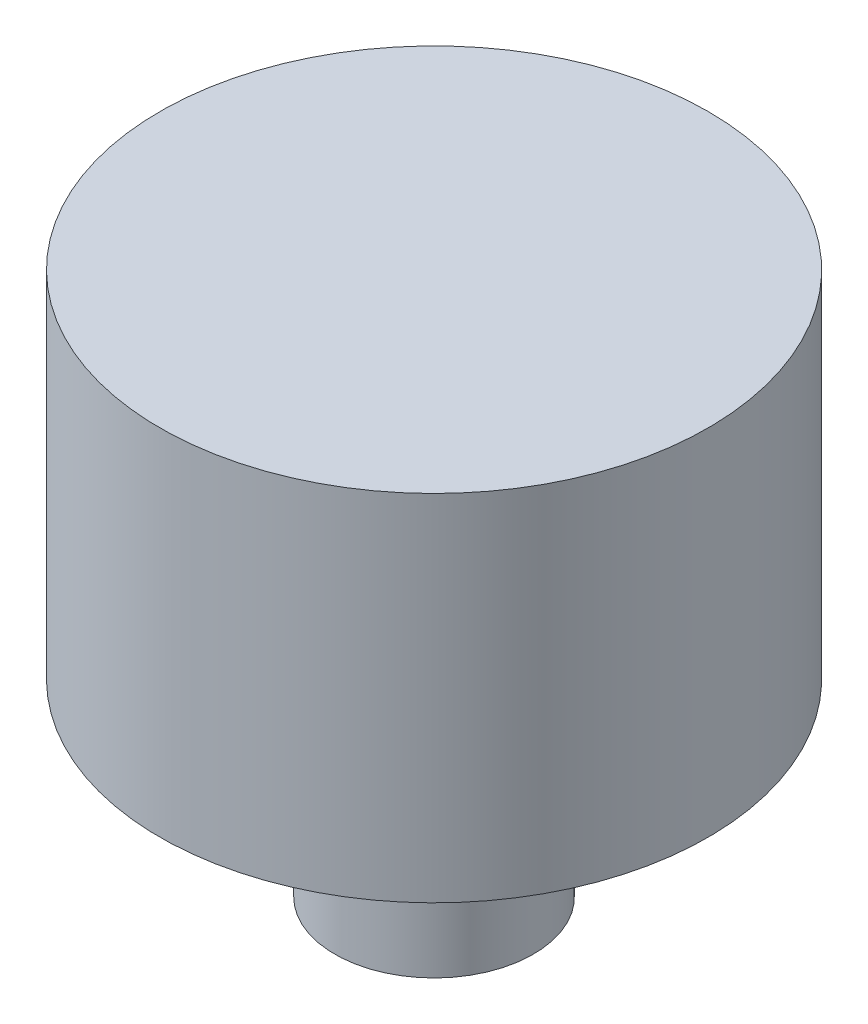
ISO-10303-21;
HEADER;
FILE_DESCRIPTION(('STEP AP214'),'2;1');
FILE_NAME('part.step','',(''),(''),'','','');
FILE_SCHEMA(('AUTOMOTIVE_DESIGN { 1 0 10303 214 1 1 1 1 }'));
ENDSEC;
DATA;
#1=APPLICATION_CONTEXT('core data for automotive mechanical design processes');
#2=APPLICATION_PROTOCOL_DEFINITION('international standard','automotive_design',2000,#1);
#3=PRODUCT_CONTEXT('',#1,'mechanical');
#4=PRODUCT('Part','Part','',(#3));
#5=PRODUCT_RELATED_PRODUCT_CATEGORY('part','',(#4));
#6=PRODUCT_DEFINITION_FORMATION('','',#4);
#7=PRODUCT_DEFINITION_CONTEXT('part definition',#1,'design');
#8=PRODUCT_DEFINITION('design','',#6,#7);
#9=PRODUCT_DEFINITION_SHAPE('','',#8);
#10=(LENGTH_UNIT() NAMED_UNIT(*) SI_UNIT(.MILLI.,.METRE.));
#11=(NAMED_UNIT(*) PLANE_ANGLE_UNIT() SI_UNIT($,.RADIAN.));
#12=(NAMED_UNIT(*) SI_UNIT($,.STERADIAN.) SOLID_ANGLE_UNIT());
#13=UNCERTAINTY_MEASURE_WITH_UNIT(LENGTH_MEASURE(1.E-05),#10,'distance_accuracy_value','');
#14=(GEOMETRIC_REPRESENTATION_CONTEXT(3) GLOBAL_UNCERTAINTY_ASSIGNED_CONTEXT((#13)) GLOBAL_UNIT_ASSIGNED_CONTEXT((#10,
#11,#12)) REPRESENTATION_CONTEXT('',''));
#15=CARTESIAN_POINT('',(0.,0.,0.));
#16=DIRECTION('',(0.,0.,1.));
#17=DIRECTION('',(1.,0.,0.));
#18=AXIS2_PLACEMENT_3D('',#15,#16,#17);
#19=CARTESIAN_POINT('',(0.,17.85,0.));
#20=DIRECTION('',(0.,-1.,0.));
#21=DIRECTION('',(0.,0.,-1.));
#22=AXIS2_PLACEMENT_3D('',#19,#20,#21);
#23=CYLINDRICAL_SURFACE('',#22,27.6000000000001);
#24=CARTESIAN_POINT('',(0.,17.85,0.));
#25=DIRECTION('',(0.,1.,0.));
#26=DIRECTION('',(0.,0.,1.));
#27=AXIS2_PLACEMENT_3D('',#24,#25,#26);
#28=CIRCLE('',#27,27.6000000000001);
#29=CARTESIAN_POINT('',(0.,17.85,-27.6000000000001));
#30=VERTEX_POINT('',#29);
#31=EDGE_CURVE('E41',#30,#30,#28,.T.);
#32=CARTESIAN_POINT('',(0.,-17.85,0.));
#33=DIRECTION('',(0.,1.,0.));
#34=DIRECTION('',(0.,0.,1.));
#35=AXIS2_PLACEMENT_3D('',#32,#33,#34);
#36=CIRCLE('',#35,27.6000000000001);
#37=CARTESIAN_POINT('',(0.,-17.85,-27.6000000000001));
#38=VERTEX_POINT('',#37);
#39=EDGE_CURVE('E37',#38,#38,#36,.T.);
#40=CARTESIAN_POINT('',(0.,17.85,-27.6000000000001));
#41=CARTESIAN_POINT('',(0.,17.478125,-27.6000000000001));
#42=CARTESIAN_POINT('',(0.,17.10625,-27.6000000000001));
#43=CARTESIAN_POINT('',(0.,16.3625,-27.6000000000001));
#44=CARTESIAN_POINT('',(0.,15.990625,-27.6000000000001));
#45=CARTESIAN_POINT('',(0.,15.246875,-27.6000000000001));
#46=CARTESIAN_POINT('',(0.,14.875,-27.6000000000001));
#47=CARTESIAN_POINT('',(0.,14.13125,-27.6000000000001));
#48=CARTESIAN_POINT('',(0.,13.759375,-27.6000000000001));
#49=CARTESIAN_POINT('',(0.,13.015625,-27.6000000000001));
#50=CARTESIAN_POINT('',(0.,12.64375,-27.6000000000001));
#51=CARTESIAN_POINT('',(0.,11.9,-27.6000000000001));
#52=CARTESIAN_POINT('',(0.,11.528125,-27.6000000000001));
#53=CARTESIAN_POINT('',(0.,10.784375,-27.6000000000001));
#54=CARTESIAN_POINT('',(0.,10.4125,-27.6000000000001));
#55=CARTESIAN_POINT('',(0.,9.66875,-27.6000000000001));
#56=CARTESIAN_POINT('',(0.,9.296875,-27.6000000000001));
#57=CARTESIAN_POINT('',(0.,8.553125,-27.6000000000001));
#58=CARTESIAN_POINT('',(0.,8.18125,-27.6000000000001));
#59=CARTESIAN_POINT('',(0.,7.4375,-27.6000000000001));
#60=CARTESIAN_POINT('',(0.,7.065625,-27.6000000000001));
#61=CARTESIAN_POINT('',(0.,6.321875,-27.6000000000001));
#62=CARTESIAN_POINT('',(0.,5.95,-27.6000000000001));
#63=CARTESIAN_POINT('',(0.,5.20625,-27.6000000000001));
#64=CARTESIAN_POINT('',(0.,4.834375,-27.6000000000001));
#65=CARTESIAN_POINT('',(0.,4.090625,-27.6000000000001));
#66=CARTESIAN_POINT('',(0.,3.71875,-27.6000000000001));
#67=CARTESIAN_POINT('',(0.,2.975,-27.6000000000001));
#68=CARTESIAN_POINT('',(0.,2.603125,-27.6000000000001));
#69=CARTESIAN_POINT('',(0.,1.859375,-27.6000000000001));
#70=CARTESIAN_POINT('',(0.,1.4875,-27.6000000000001));
#71=CARTESIAN_POINT('',(0.,0.743749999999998,-27.6000000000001));
#72=CARTESIAN_POINT('',(0.,0.371874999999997,-27.6000000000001));
#73=CARTESIAN_POINT('',(0.,-0.371875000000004,-27.6000000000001));
#74=CARTESIAN_POINT('',(0.,-0.743750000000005,-27.6000000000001));
#75=CARTESIAN_POINT('',(0.,-1.48750000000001,-27.6000000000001));
#76=CARTESIAN_POINT('',(0.,-1.859375,-27.6000000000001));
#77=CARTESIAN_POINT('',(0.,-2.603125,-27.6000000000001));
#78=CARTESIAN_POINT('',(0.,-2.975,-27.6000000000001));
#79=CARTESIAN_POINT('',(0.,-3.71875,-27.6000000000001));
#80=CARTESIAN_POINT('',(0.,-4.090625,-27.6000000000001));
#81=CARTESIAN_POINT('',(0.,-4.834375,-27.6000000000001));
#82=CARTESIAN_POINT('',(0.,-5.20625000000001,-27.6000000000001));
#83=CARTESIAN_POINT('',(0.,-5.95000000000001,-27.6000000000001));
#84=CARTESIAN_POINT('',(0.,-6.32187500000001,-27.6000000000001));
#85=CARTESIAN_POINT('',(0.,-7.06562500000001,-27.6000000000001));
#86=CARTESIAN_POINT('',(0.,-7.4375,-27.6000000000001));
#87=CARTESIAN_POINT('',(0.,-8.18125,-27.6000000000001));
#88=CARTESIAN_POINT('',(0.,-8.553125,-27.6000000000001));
#89=CARTESIAN_POINT('',(0.,-9.29687500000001,-27.6000000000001));
#90=CARTESIAN_POINT('',(0.,-9.66875000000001,-27.6000000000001));
#91=CARTESIAN_POINT('',(0.,-10.4125,-27.6000000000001));
#92=CARTESIAN_POINT('',(0.,-10.784375,-27.6000000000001));
#93=CARTESIAN_POINT('',(0.,-11.528125,-27.6000000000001));
#94=CARTESIAN_POINT('',(0.,-11.9,-27.6000000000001));
#95=CARTESIAN_POINT('',(0.,-12.64375,-27.6000000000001));
#96=CARTESIAN_POINT('',(0.,-13.015625,-27.6000000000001));
#97=CARTESIAN_POINT('',(0.,-13.759375,-27.6000000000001));
#98=CARTESIAN_POINT('',(0.,-14.13125,-27.6000000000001));
#99=CARTESIAN_POINT('',(0.,-14.875,-27.6000000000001));
#100=CARTESIAN_POINT('',(0.,-15.246875,-27.6000000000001));
#101=CARTESIAN_POINT('',(0.,-15.990625,-27.6000000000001));
#102=CARTESIAN_POINT('',(0.,-16.3625,-27.6000000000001));
#103=CARTESIAN_POINT('',(0.,-17.10625,-27.6000000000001));
#104=CARTESIAN_POINT('',(0.,-17.478125,-27.6000000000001));
#105=CARTESIAN_POINT('',(0.,-17.85,-27.6000000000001));
#106=B_SPLINE_CURVE_WITH_KNOTS('',3,(#40,#41,#42,#43,#44,#45,#46,#47,#48,#49,#50,#51,#52,#53,
#54,#55,#56,#57,#58,#59,#60,#61,#62,#63,#64,#65,#66,#67,#68,#69,#70,#71,#72,#73,#74,#75,#76,#77,
#78,#79,#80,#81,#82,#83,#84,#85,#86,#87,#88,#89,#90,#91,#92,#93,#94,#95,#96,#97,#98,#99,#100,
#101,#102,#103,#104,#105),.UNSPECIFIED.,.F.,.F.,(4,2,2,2,2,2,2,2,2,2,2,2,2,2,2,2,2,2,2,2,2,2,2,
2,2,2,2,2,2,2,2,2,4),(0.,1.115625,2.23125,3.346875,4.4625,5.578125,6.69375,7.809375,8.925,
10.040625,11.15625,12.271875,13.3875,14.503125,15.61875,16.734375,17.85,18.965625,20.08125,
21.196875,22.3125,23.428125,24.54375,25.659375,26.775,27.890625,29.00625,30.121875,31.2375,
32.353125,33.46875,34.584375,35.7),.UNSPECIFIED.);
#107=EDGE_CURVE('BSEAM34',#30,#38,#106,.T.);
#108=ORIENTED_EDGE('',*,*,#31,.F.);
#109=ORIENTED_EDGE('',*,*,#39,.T.);
#110=ORIENTED_EDGE('',*,*,#107,.T.);
#111=ORIENTED_EDGE('',*,*,#107,.F.);
#112=EDGE_LOOP('',(#108,#110,#109,#111));
#113=FACE_BOUND('',#112,.T.);
#114=ADVANCED_FACE('F34',(#113),#23,.T.);
#115=CARTESIAN_POINT('',(0.,17.85,0.));
#116=DIRECTION('',(0.,1.,0.));
#117=DIRECTION('',(0.,0.,1.));
#118=AXIS2_PLACEMENT_3D('',#115,#116,#117);
#119=PLANE('',#118);
#120=ORIENTED_EDGE('',*,*,#31,.T.);
#121=EDGE_LOOP('',(#120));
#122=FACE_BOUND('',#121,.T.);
#123=ADVANCED_FACE('F58',(#122),#119,.T.);
#124=CARTESIAN_POINT('',(0.,-17.85,0.));
#125=DIRECTION('',(0.,1.,0.));
#126=DIRECTION('',(0.,0.,1.));
#127=AXIS2_PLACEMENT_3D('',#124,#125,#126);
#128=PLANE('',#127);
#129=CARTESIAN_POINT('',(0.,-17.85,0.));
#130=DIRECTION('',(0.,-1.,0.));
#131=DIRECTION('',(0.,0.,-1.));
#132=AXIS2_PLACEMENT_3D('',#129,#130,#131);
#133=CIRCLE('',#132,10.);
#134=CARTESIAN_POINT('',(0.,-17.85,-10.));
#135=VERTEX_POINT('',#134);
#136=EDGE_CURVE('E10',#135,#135,#133,.T.);
#137=ORIENTED_EDGE('',*,*,#136,.F.);
#138=EDGE_LOOP('',(#137));
#139=FACE_BOUND('',#138,.T.);
#140=ORIENTED_EDGE('',*,*,#39,.F.);
#141=EDGE_LOOP('',(#140));
#142=FACE_BOUND('',#141,.T.);
#143=ADVANCED_FACE('F55',(#139,#142),#128,.F.);
#144=CARTESIAN_POINT('',(0.,-36.85,0.));
#145=DIRECTION('',(0.,1.,0.));
#146=DIRECTION('',(0.,0.,1.));
#147=AXIS2_PLACEMENT_3D('',#144,#145,#146);
#148=CYLINDRICAL_SURFACE('',#147,10.);
#149=CARTESIAN_POINT('',(0.,-36.85,0.));
#150=DIRECTION('',(0.,-1.,0.));
#151=DIRECTION('',(0.,0.,-1.));
#152=AXIS2_PLACEMENT_3D('',#149,#150,#151);
#153=CIRCLE('',#152,10.);
#154=CARTESIAN_POINT('',(0.,-36.85,-10.));
#155=VERTEX_POINT('',#154);
#156=EDGE_CURVE('E47',#155,#155,#153,.T.);
#157=ORIENTED_EDGE('',*,*,#156,.F.);
#158=EDGE_LOOP('',(#157));
#159=FACE_BOUND('',#158,.T.);
#160=ORIENTED_EDGE('',*,*,#136,.T.);
#161=EDGE_LOOP('',(#160));
#162=FACE_BOUND('',#161,.T.);
#163=ADVANCED_FACE('F57',(#159,#162),#148,.T.);
#164=CARTESIAN_POINT('',(0.,-36.85,0.));
#165=DIRECTION('',(0.,-1.,0.));
#166=DIRECTION('',(0.,0.,-1.));
#167=AXIS2_PLACEMENT_3D('',#164,#165,#166);
#168=PLANE('',#167);
#169=ORIENTED_EDGE('',*,*,#156,.T.);
#170=EDGE_LOOP('',(#169));
#171=FACE_BOUND('',#170,.T.);
#172=ADVANCED_FACE('F64',(#171),#168,.T.);
#173=CLOSED_SHELL('',(#114,#123,#143,#163,#172));
#174=MANIFOLD_SOLID_BREP('B2',#173);
#175=ADVANCED_BREP_SHAPE_REPRESENTATION('',(#18,#174),#14);
#176=SHAPE_DEFINITION_REPRESENTATION(#9,#175);
ENDSEC;
END-ISO-10303-21;
